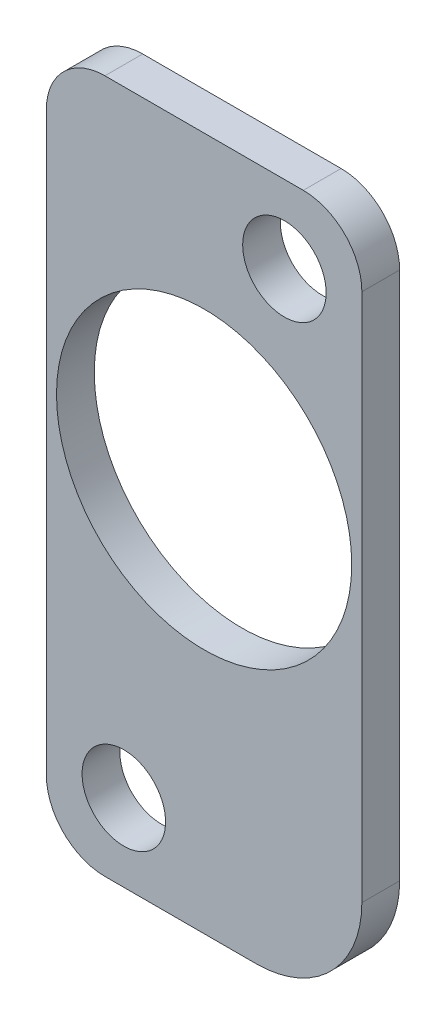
ISO-10303-21;
HEADER;
FILE_DESCRIPTION(('STEP AP214'),'2;1');
FILE_NAME('part.step','',(''),(''),'','','');
FILE_SCHEMA(('AUTOMOTIVE_DESIGN { 1 0 10303 214 1 1 1 1 }'));
ENDSEC;
DATA;
#1=APPLICATION_CONTEXT('core data for automotive mechanical design processes');
#2=APPLICATION_PROTOCOL_DEFINITION('international standard','automotive_design',2000,#1);
#3=PRODUCT_CONTEXT('',#1,'mechanical');
#4=PRODUCT('Part','Part','',(#3));
#5=PRODUCT_RELATED_PRODUCT_CATEGORY('part','',(#4));
#6=PRODUCT_DEFINITION_FORMATION('','',#4);
#7=PRODUCT_DEFINITION_CONTEXT('part definition',#1,'design');
#8=PRODUCT_DEFINITION('design','',#6,#7);
#9=PRODUCT_DEFINITION_SHAPE('','',#8);
#10=(LENGTH_UNIT() NAMED_UNIT(*) SI_UNIT(.MILLI.,.METRE.));
#11=(NAMED_UNIT(*) PLANE_ANGLE_UNIT() SI_UNIT($,.RADIAN.));
#12=(NAMED_UNIT(*) SI_UNIT($,.STERADIAN.) SOLID_ANGLE_UNIT());
#13=UNCERTAINTY_MEASURE_WITH_UNIT(LENGTH_MEASURE(1.E-05),#10,'distance_accuracy_value','');
#14=(GEOMETRIC_REPRESENTATION_CONTEXT(3) GLOBAL_UNCERTAINTY_ASSIGNED_CONTEXT((#13)) GLOBAL_UNIT_ASSIGNED_CONTEXT((#10,
#11,#12)) REPRESENTATION_CONTEXT('',''));
#15=CARTESIAN_POINT('',(0.,0.,0.));
#16=DIRECTION('',(0.,0.,1.));
#17=DIRECTION('',(1.,0.,0.));
#18=AXIS2_PLACEMENT_3D('',#15,#16,#17);
#19=CARTESIAN_POINT('',(-754.411295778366,-14.7238728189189,-29.21));
#20=DIRECTION('',(0.,0.,-1.));
#21=DIRECTION('',(-1.,0.,0.));
#22=AXIS2_PLACEMENT_3D('',#19,#20,#21);
#23=CYLINDRICAL_SURFACE('',#22,3.93699999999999);
#24=CARTESIAN_POINT('',(-754.411295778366,-14.7238728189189,-31.75));
#25=DIRECTION('',(0.,0.,-1.));
#26=DIRECTION('',(-1.,0.,0.));
#27=AXIS2_PLACEMENT_3D('',#24,#25,#26);
#28=CIRCLE('',#27,3.93699999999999);
#29=CARTESIAN_POINT('',(-754.411295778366,-10.7868728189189,-31.75));
#30=VERTEX_POINT('',#29);
#31=CARTESIAN_POINT('',(-750.474295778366,-14.7238728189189,-31.75));
#32=VERTEX_POINT('',#31);
#33=EDGE_CURVE('E155',#30,#32,#28,.T.);
#34=ORIENTED_EDGE('',*,*,#33,.F.);
#35=DIRECTION('',(0.,0.,-1.));
#36=VECTOR('',#35,1.);
#37=CARTESIAN_POINT('',(-754.411295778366,-10.7868728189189,-29.21));
#38=LINE('',#37,#36);
#39=CARTESIAN_POINT('',(-754.411295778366,-10.7868728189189,-29.21));
#40=VERTEX_POINT('',#39);
#41=EDGE_CURVE('E11',#40,#30,#38,.T.);
#42=ORIENTED_EDGE('',*,*,#41,.F.);
#43=CARTESIAN_POINT('',(-754.411295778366,-14.7238728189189,-29.21));
#44=DIRECTION('',(0.,0.,-1.));
#45=DIRECTION('',(-1.,0.,0.));
#46=AXIS2_PLACEMENT_3D('',#43,#44,#45);
#47=CIRCLE('',#46,3.93699999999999);
#48=CARTESIAN_POINT('',(-750.474295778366,-14.7238728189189,-29.21));
#49=VERTEX_POINT('',#48);
#50=EDGE_CURVE('E184',#40,#49,#47,.T.);
#51=ORIENTED_EDGE('',*,*,#50,.T.);
#52=DIRECTION('',(0.,0.,-1.));
#53=VECTOR('',#52,1.);
#54=CARTESIAN_POINT('',(-750.474295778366,-14.7238728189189,-29.21));
#55=LINE('',#54,#53);
#56=EDGE_CURVE('E52',#49,#32,#55,.T.);
#57=ORIENTED_EDGE('',*,*,#56,.T.);
#58=EDGE_LOOP('',(#34,#42,#51,#57));
#59=FACE_BOUND('',#58,.T.);
#60=ADVANCED_FACE('F49',(#59),#23,.T.);
#61=CARTESIAN_POINT('',(-767.746295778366,-10.7868728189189,-29.21));
#62=DIRECTION('',(0.,1.,0.));
#63=DIRECTION('',(-1.,0.,0.));
#64=AXIS2_PLACEMENT_3D('',#61,#62,#63);
#65=PLANE('',#64);
#66=DIRECTION('',(1.,0.,0.));
#67=VECTOR('',#66,1.);
#68=CARTESIAN_POINT('',(-767.746295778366,-10.7868728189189,-31.75));
#69=LINE('',#68,#67);
#70=CARTESIAN_POINT('',(-767.746295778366,-10.7868728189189,-31.75));
#71=VERTEX_POINT('',#70);
#72=EDGE_CURVE('E181',#71,#30,#69,.T.);
#73=ORIENTED_EDGE('',*,*,#72,.F.);
#74=DIRECTION('',(0.,0.,-1.));
#75=VECTOR('',#74,1.);
#76=CARTESIAN_POINT('',(-767.746295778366,-10.7868728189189,-29.21));
#77=LINE('',#76,#75);
#78=CARTESIAN_POINT('',(-767.746295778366,-10.7868728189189,-29.21));
#79=VERTEX_POINT('',#78);
#80=EDGE_CURVE('E59',#79,#71,#77,.T.);
#81=ORIENTED_EDGE('',*,*,#80,.F.);
#82=DIRECTION('',(1.,0.,0.));
#83=VECTOR('',#82,1.);
#84=CARTESIAN_POINT('',(-767.746295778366,-10.7868728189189,-29.21));
#85=LINE('',#84,#83);
#86=EDGE_CURVE('E141',#79,#40,#85,.T.);
#87=ORIENTED_EDGE('',*,*,#86,.T.);
#88=ORIENTED_EDGE('',*,*,#41,.T.);
#89=EDGE_LOOP('',(#73,#81,#87,#88));
#90=FACE_BOUND('',#89,.T.);
#91=ADVANCED_FACE('F202',(#90),#65,.T.);
#92=CARTESIAN_POINT('',(-767.746295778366,-14.7238728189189,-29.21));
#93=DIRECTION('',(0.,0.,-1.));
#94=DIRECTION('',(-1.,0.,0.));
#95=AXIS2_PLACEMENT_3D('',#92,#93,#94);
#96=CYLINDRICAL_SURFACE('',#95,3.93700000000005);
#97=CARTESIAN_POINT('',(-767.746295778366,-14.7238728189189,-31.75));
#98=DIRECTION('',(0.,0.,-1.));
#99=DIRECTION('',(-1.,0.,0.));
#100=AXIS2_PLACEMENT_3D('',#97,#98,#99);
#101=CIRCLE('',#100,3.93700000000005);
#102=CARTESIAN_POINT('',(-771.683295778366,-14.7238728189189,-31.75));
#103=VERTEX_POINT('',#102);
#104=EDGE_CURVE('E127',#103,#71,#101,.T.);
#105=ORIENTED_EDGE('',*,*,#104,.F.);
#106=DIRECTION('',(0.,0.,-1.));
#107=VECTOR('',#106,1.);
#108=CARTESIAN_POINT('',(-771.683295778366,-14.7238728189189,-29.21));
#109=LINE('',#108,#107);
#110=CARTESIAN_POINT('',(-771.683295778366,-14.7238728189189,-29.21));
#111=VERTEX_POINT('',#110);
#112=EDGE_CURVE('E122',#111,#103,#109,.T.);
#113=ORIENTED_EDGE('',*,*,#112,.F.);
#114=CARTESIAN_POINT('',(-767.746295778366,-14.7238728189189,-29.21));
#115=DIRECTION('',(0.,0.,-1.));
#116=DIRECTION('',(-1.,0.,0.));
#117=AXIS2_PLACEMENT_3D('',#114,#115,#116);
#118=CIRCLE('',#117,3.93700000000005);
#119=EDGE_CURVE('E125',#111,#79,#118,.T.);
#120=ORIENTED_EDGE('',*,*,#119,.T.);
#121=ORIENTED_EDGE('',*,*,#80,.T.);
#122=EDGE_LOOP('',(#105,#113,#120,#121));
#123=FACE_BOUND('',#122,.T.);
#124=ADVANCED_FACE('F124',(#123),#96,.T.);
#125=CARTESIAN_POINT('',(-771.683295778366,-53.4588728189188,-29.21));
#126=DIRECTION('',(-1.,0.,0.));
#127=DIRECTION('',(0.,-1.,0.));
#128=AXIS2_PLACEMENT_3D('',#125,#126,#127);
#129=PLANE('',#128);
#130=DIRECTION('',(0.,1.,0.));
#131=VECTOR('',#130,1.);
#132=CARTESIAN_POINT('',(-771.683295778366,-53.4588728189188,-31.75));
#133=LINE('',#132,#131);
#134=CARTESIAN_POINT('',(-771.683295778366,-53.4588728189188,-31.75));
#135=VERTEX_POINT('',#134);
#136=EDGE_CURVE('E176',#135,#103,#133,.T.);
#137=ORIENTED_EDGE('',*,*,#136,.F.);
#138=DIRECTION('',(0.,0.,-1.));
#139=VECTOR('',#138,1.);
#140=CARTESIAN_POINT('',(-771.683295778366,-53.4588728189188,-29.21));
#141=LINE('',#140,#139);
#142=CARTESIAN_POINT('',(-771.683295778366,-53.4588728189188,-29.21));
#143=VERTEX_POINT('',#142);
#144=EDGE_CURVE('E133',#143,#135,#141,.T.);
#145=ORIENTED_EDGE('',*,*,#144,.F.);
#146=DIRECTION('',(0.,1.,0.));
#147=VECTOR('',#146,1.);
#148=CARTESIAN_POINT('',(-771.683295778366,-53.4588728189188,-29.21));
#149=LINE('',#148,#147);
#150=EDGE_CURVE('E139',#143,#111,#149,.T.);
#151=ORIENTED_EDGE('',*,*,#150,.T.);
#152=ORIENTED_EDGE('',*,*,#112,.T.);
#153=EDGE_LOOP('',(#137,#145,#151,#152));
#154=FACE_BOUND('',#153,.T.);
#155=ADVANCED_FACE('F144',(#154),#129,.T.);
#156=CARTESIAN_POINT('',(-767.746295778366,-53.4588728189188,-29.21));
#157=DIRECTION('',(0.,0.,-1.));
#158=DIRECTION('',(-1.,0.,0.));
#159=AXIS2_PLACEMENT_3D('',#156,#157,#158);
#160=CYLINDRICAL_SURFACE('',#159,3.93699999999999);
#161=CARTESIAN_POINT('',(-767.746295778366,-53.4588728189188,-31.75));
#162=DIRECTION('',(0.,0.,-1.));
#163=DIRECTION('',(-1.,0.,0.));
#164=AXIS2_PLACEMENT_3D('',#161,#162,#163);
#165=CIRCLE('',#164,3.93699999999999);
#166=CARTESIAN_POINT('',(-767.746295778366,-57.3958728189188,-31.75));
#167=VERTEX_POINT('',#166);
#168=EDGE_CURVE('E172',#167,#135,#165,.T.);
#169=ORIENTED_EDGE('',*,*,#168,.F.);
#170=DIRECTION('',(0.,0.,-1.));
#171=VECTOR('',#170,1.);
#172=CARTESIAN_POINT('',(-767.746295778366,-57.3958728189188,-29.21));
#173=LINE('',#172,#171);
#174=CARTESIAN_POINT('',(-767.746295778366,-57.3958728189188,-29.21));
#175=VERTEX_POINT('',#174);
#176=EDGE_CURVE('E190',#175,#167,#173,.T.);
#177=ORIENTED_EDGE('',*,*,#176,.F.);
#178=CARTESIAN_POINT('',(-767.746295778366,-53.4588728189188,-29.21));
#179=DIRECTION('',(0.,0.,-1.));
#180=DIRECTION('',(-1.,0.,0.));
#181=AXIS2_PLACEMENT_3D('',#178,#179,#180);
#182=CIRCLE('',#181,3.93699999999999);
#183=EDGE_CURVE('E146',#175,#143,#182,.T.);
#184=ORIENTED_EDGE('',*,*,#183,.T.);
#185=ORIENTED_EDGE('',*,*,#144,.T.);
#186=EDGE_LOOP('',(#169,#177,#184,#185));
#187=FACE_BOUND('',#186,.T.);
#188=ADVANCED_FACE('F215',(#187),#160,.T.);
#189=CARTESIAN_POINT('',(-757.586295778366,-57.3958728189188,-29.21));
#190=DIRECTION('',(0.,-1.,0.));
#191=DIRECTION('',(1.,0.,0.));
#192=AXIS2_PLACEMENT_3D('',#189,#190,#191);
#193=PLANE('',#192);
#194=DIRECTION('',(-1.,0.,0.));
#195=VECTOR('',#194,1.);
#196=CARTESIAN_POINT('',(-757.586295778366,-57.3958728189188,-31.75));
#197=LINE('',#196,#195);
#198=CARTESIAN_POINT('',(-757.586295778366,-57.3958728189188,-31.75));
#199=VERTEX_POINT('',#198);
#200=EDGE_CURVE('E168',#199,#167,#197,.T.);
#201=ORIENTED_EDGE('',*,*,#200,.F.);
#202=DIRECTION('',(0.,0.,-1.));
#203=VECTOR('',#202,1.);
#204=CARTESIAN_POINT('',(-757.586295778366,-57.3958728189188,-29.21));
#205=LINE('',#204,#203);
#206=CARTESIAN_POINT('',(-757.586295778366,-57.3958728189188,-29.21));
#207=VERTEX_POINT('',#206);
#208=EDGE_CURVE('E193',#207,#199,#205,.T.);
#209=ORIENTED_EDGE('',*,*,#208,.F.);
#210=DIRECTION('',(-1.,0.,0.));
#211=VECTOR('',#210,1.);
#212=CARTESIAN_POINT('',(-757.586295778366,-57.3958728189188,-29.21));
#213=LINE('',#212,#211);
#214=EDGE_CURVE('E149',#207,#175,#213,.T.);
#215=ORIENTED_EDGE('',*,*,#214,.T.);
#216=ORIENTED_EDGE('',*,*,#176,.T.);
#217=EDGE_LOOP('',(#201,#209,#215,#216));
#218=FACE_BOUND('',#217,.T.);
#219=ADVANCED_FACE('F218',(#218),#193,.T.);
#220=CARTESIAN_POINT('',(-757.586295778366,-50.2838728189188,-29.21));
#221=DIRECTION('',(0.,0.,-1.));
#222=DIRECTION('',(-1.,0.,0.));
#223=AXIS2_PLACEMENT_3D('',#220,#221,#222);
#224=CYLINDRICAL_SURFACE('',#223,7.11199999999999);
#225=CARTESIAN_POINT('',(-757.586295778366,-50.2838728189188,-31.75));
#226=DIRECTION('',(0.,0.,-1.));
#227=DIRECTION('',(-1.,0.,0.));
#228=AXIS2_PLACEMENT_3D('',#225,#226,#227);
#229=CIRCLE('',#228,7.11199999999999);
#230=CARTESIAN_POINT('',(-750.474295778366,-50.2838728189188,-31.75));
#231=VERTEX_POINT('',#230);
#232=EDGE_CURVE('E164',#231,#199,#229,.T.);
#233=ORIENTED_EDGE('',*,*,#232,.F.);
#234=DIRECTION('',(0.,0.,-1.));
#235=VECTOR('',#234,1.);
#236=CARTESIAN_POINT('',(-750.474295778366,-50.2838728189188,-29.21));
#237=LINE('',#236,#235);
#238=CARTESIAN_POINT('',(-750.474295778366,-50.2838728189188,-29.21));
#239=VERTEX_POINT('',#238);
#240=EDGE_CURVE('E195',#239,#231,#237,.T.);
#241=ORIENTED_EDGE('',*,*,#240,.F.);
#242=CARTESIAN_POINT('',(-757.586295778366,-50.2838728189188,-29.21));
#243=DIRECTION('',(0.,0.,-1.));
#244=DIRECTION('',(-1.,0.,0.));
#245=AXIS2_PLACEMENT_3D('',#242,#243,#244);
#246=CIRCLE('',#245,7.11199999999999);
#247=EDGE_CURVE('E279',#239,#207,#246,.T.);
#248=ORIENTED_EDGE('',*,*,#247,.T.);
#249=ORIENTED_EDGE('',*,*,#208,.T.);
#250=EDGE_LOOP('',(#233,#241,#248,#249));
#251=FACE_BOUND('',#250,.T.);
#252=ADVANCED_FACE('F222',(#251),#224,.T.);
#253=CARTESIAN_POINT('',(-750.474295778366,-14.7238728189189,-29.21));
#254=DIRECTION('',(1.,0.,0.));
#255=DIRECTION('',(0.,1.,0.));
#256=AXIS2_PLACEMENT_3D('',#253,#254,#255);
#257=PLANE('',#256);
#258=DIRECTION('',(0.,-1.,0.));
#259=VECTOR('',#258,1.);
#260=CARTESIAN_POINT('',(-750.474295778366,-14.7238728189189,-31.75));
#261=LINE('',#260,#259);
#262=EDGE_CURVE('E159',#32,#231,#261,.T.);
#263=ORIENTED_EDGE('',*,*,#262,.F.);
#264=ORIENTED_EDGE('',*,*,#56,.F.);
#265=DIRECTION('',(0.,-1.,0.));
#266=VECTOR('',#265,1.);
#267=CARTESIAN_POINT('',(-750.474295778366,-14.7238728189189,-29.21));
#268=LINE('',#267,#266);
#269=EDGE_CURVE('E276',#49,#239,#268,.T.);
#270=ORIENTED_EDGE('',*,*,#269,.T.);
#271=ORIENTED_EDGE('',*,*,#240,.T.);
#272=EDGE_LOOP('',(#263,#264,#270,#271));
#273=FACE_BOUND('',#272,.T.);
#274=ADVANCED_FACE('F199',(#273),#257,.T.);
#275=CARTESIAN_POINT('',(-754.411295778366,-14.7238728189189,-29.21));
#276=DIRECTION('',(0.,0.,-1.));
#277=DIRECTION('',(-1.,0.,0.));
#278=AXIS2_PLACEMENT_3D('',#275,#276,#277);
#279=PLANE('',#278);
#280=CARTESIAN_POINT('',(-761.078795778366,-30.9504062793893,-29.21));
#281=DIRECTION('',(0.,0.,-1.));
#282=DIRECTION('',(-1.,0.,0.));
#283=AXIS2_PLACEMENT_3D('',#280,#281,#282);
#284=CIRCLE('',#283,9.92187499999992);
#285=CARTESIAN_POINT('',(-771.000670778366,-30.9504062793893,-29.21));
#286=VERTEX_POINT('',#285);
#287=EDGE_CURVE('E250',#286,#286,#284,.T.);
#288=ORIENTED_EDGE('',*,*,#287,.T.);
#289=EDGE_LOOP('',(#288));
#290=FACE_BOUND('',#289,.T.);
#291=CARTESIAN_POINT('',(-766.476295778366,-52.1888728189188,-29.21));
#292=DIRECTION('',(0.,0.,-1.));
#293=DIRECTION('',(-1.,0.,0.));
#294=AXIS2_PLACEMENT_3D('',#291,#292,#293);
#295=CIRCLE('',#294,2.80669999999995);
#296=CARTESIAN_POINT('',(-769.282995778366,-52.1888728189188,-29.21));
#297=VERTEX_POINT('',#296);
#298=EDGE_CURVE('E260',#297,#297,#295,.T.);
#299=ORIENTED_EDGE('',*,*,#298,.T.);
#300=EDGE_LOOP('',(#299));
#301=FACE_BOUND('',#300,.T.);
#302=CARTESIAN_POINT('',(-755.681295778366,-15.9938728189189,-29.21));
#303=DIRECTION('',(0.,0.,-1.));
#304=DIRECTION('',(-1.,0.,0.));
#305=AXIS2_PLACEMENT_3D('',#302,#303,#304);
#306=CIRCLE('',#305,2.80669999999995);
#307=CARTESIAN_POINT('',(-758.487995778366,-15.9938728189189,-29.21));
#308=VERTEX_POINT('',#307);
#309=EDGE_CURVE('E160',#308,#308,#306,.T.);
#310=ORIENTED_EDGE('',*,*,#309,.T.);
#311=EDGE_LOOP('',(#310));
#312=FACE_BOUND('',#311,.T.);
#313=ORIENTED_EDGE('',*,*,#50,.F.);
#314=ORIENTED_EDGE('',*,*,#86,.F.);
#315=ORIENTED_EDGE('',*,*,#119,.F.);
#316=ORIENTED_EDGE('',*,*,#150,.F.);
#317=ORIENTED_EDGE('',*,*,#183,.F.);
#318=ORIENTED_EDGE('',*,*,#214,.F.);
#319=ORIENTED_EDGE('',*,*,#247,.F.);
#320=ORIENTED_EDGE('',*,*,#269,.F.);
#321=EDGE_LOOP('',(#313,#314,#315,#316,#317,#318,#319,#320));
#322=FACE_BOUND('',#321,.T.);
#323=ADVANCED_FACE('F137',(#290,#301,#312,#322),#279,.F.);
#324=CARTESIAN_POINT('',(-754.411295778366,-14.7238728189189,-31.75));
#325=DIRECTION('',(0.,0.,-1.));
#326=DIRECTION('',(-1.,0.,0.));
#327=AXIS2_PLACEMENT_3D('',#324,#325,#326);
#328=PLANE('',#327);
#329=CARTESIAN_POINT('',(-761.078795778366,-30.9504062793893,-31.75));
#330=DIRECTION('',(0.,0.,-1.));
#331=DIRECTION('',(-1.,0.,0.));
#332=AXIS2_PLACEMENT_3D('',#329,#330,#331);
#333=CIRCLE('',#332,9.92187499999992);
#334=CARTESIAN_POINT('',(-771.000670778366,-30.9504062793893,-31.75));
#335=VERTEX_POINT('',#334);
#336=EDGE_CURVE('E253',#335,#335,#333,.T.);
#337=ORIENTED_EDGE('',*,*,#336,.F.);
#338=EDGE_LOOP('',(#337));
#339=FACE_BOUND('',#338,.T.);
#340=CARTESIAN_POINT('',(-766.476295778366,-52.1888728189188,-31.75));
#341=DIRECTION('',(0.,0.,-1.));
#342=DIRECTION('',(-1.,0.,0.));
#343=AXIS2_PLACEMENT_3D('',#340,#341,#342);
#344=CIRCLE('',#343,2.80669999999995);
#345=CARTESIAN_POINT('',(-769.282995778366,-52.1888728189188,-31.75));
#346=VERTEX_POINT('',#345);
#347=EDGE_CURVE('E257',#346,#346,#344,.T.);
#348=ORIENTED_EDGE('',*,*,#347,.F.);
#349=EDGE_LOOP('',(#348));
#350=FACE_BOUND('',#349,.T.);
#351=CARTESIAN_POINT('',(-755.681295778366,-15.9938728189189,-31.75));
#352=DIRECTION('',(0.,0.,-1.));
#353=DIRECTION('',(-1.,0.,0.));
#354=AXIS2_PLACEMENT_3D('',#351,#352,#353);
#355=CIRCLE('',#354,2.80669999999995);
#356=CARTESIAN_POINT('',(-758.487995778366,-15.9938728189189,-31.75));
#357=VERTEX_POINT('',#356);
#358=EDGE_CURVE('E264',#357,#357,#355,.T.);
#359=ORIENTED_EDGE('',*,*,#358,.F.);
#360=EDGE_LOOP('',(#359));
#361=FACE_BOUND('',#360,.T.);
#362=ORIENTED_EDGE('',*,*,#33,.T.);
#363=ORIENTED_EDGE('',*,*,#262,.T.);
#364=ORIENTED_EDGE('',*,*,#232,.T.);
#365=ORIENTED_EDGE('',*,*,#200,.T.);
#366=ORIENTED_EDGE('',*,*,#168,.T.);
#367=ORIENTED_EDGE('',*,*,#136,.T.);
#368=ORIENTED_EDGE('',*,*,#104,.T.);
#369=ORIENTED_EDGE('',*,*,#72,.T.);
#370=EDGE_LOOP('',(#362,#363,#364,#365,#366,#367,#368,#369));
#371=FACE_BOUND('',#370,.T.);
#372=ADVANCED_FACE('F201',(#339,#350,#361,#371),#328,.T.);
#373=CARTESIAN_POINT('',(-755.681295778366,-15.9938728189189,-29.21));
#374=DIRECTION('',(0.,0.,-1.));
#375=DIRECTION('',(-1.,0.,0.));
#376=AXIS2_PLACEMENT_3D('',#373,#374,#375);
#377=CYLINDRICAL_SURFACE('',#376,2.80669999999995);
#378=ORIENTED_EDGE('',*,*,#309,.F.);
#379=EDGE_LOOP('',(#378));
#380=FACE_BOUND('',#379,.T.);
#381=ORIENTED_EDGE('',*,*,#358,.T.);
#382=EDGE_LOOP('',(#381));
#383=FACE_BOUND('',#382,.T.);
#384=ADVANCED_FACE('F233',(#380,#383),#377,.F.);
#385=CARTESIAN_POINT('',(-766.476295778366,-52.1888728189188,-29.21));
#386=DIRECTION('',(0.,0.,-1.));
#387=DIRECTION('',(-1.,0.,0.));
#388=AXIS2_PLACEMENT_3D('',#385,#386,#387);
#389=CYLINDRICAL_SURFACE('',#388,2.80669999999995);
#390=ORIENTED_EDGE('',*,*,#298,.F.);
#391=EDGE_LOOP('',(#390));
#392=FACE_BOUND('',#391,.T.);
#393=ORIENTED_EDGE('',*,*,#347,.T.);
#394=EDGE_LOOP('',(#393));
#395=FACE_BOUND('',#394,.T.);
#396=ADVANCED_FACE('F240',(#392,#395),#389,.F.);
#397=CARTESIAN_POINT('',(-761.078795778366,-30.9504062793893,-29.21));
#398=DIRECTION('',(0.,0.,-1.));
#399=DIRECTION('',(-1.,0.,0.));
#400=AXIS2_PLACEMENT_3D('',#397,#398,#399);
#401=CYLINDRICAL_SURFACE('',#400,9.92187499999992);
#402=ORIENTED_EDGE('',*,*,#287,.F.);
#403=EDGE_LOOP('',(#402));
#404=FACE_BOUND('',#403,.T.);
#405=ORIENTED_EDGE('',*,*,#336,.T.);
#406=EDGE_LOOP('',(#405));
#407=FACE_BOUND('',#406,.T.);
#408=ADVANCED_FACE('F244',(#404,#407),#401,.F.);
#409=CLOSED_SHELL('',(#60,#91,#124,#155,#188,#219,#252,#274,#323,#372,#384,#396,#408));
#410=MANIFOLD_SOLID_BREP('B2',#409);
#411=ADVANCED_BREP_SHAPE_REPRESENTATION('',(#18,#410),#14);
#412=SHAPE_DEFINITION_REPRESENTATION(#9,#411);
ENDSEC;
END-ISO-10303-21;
